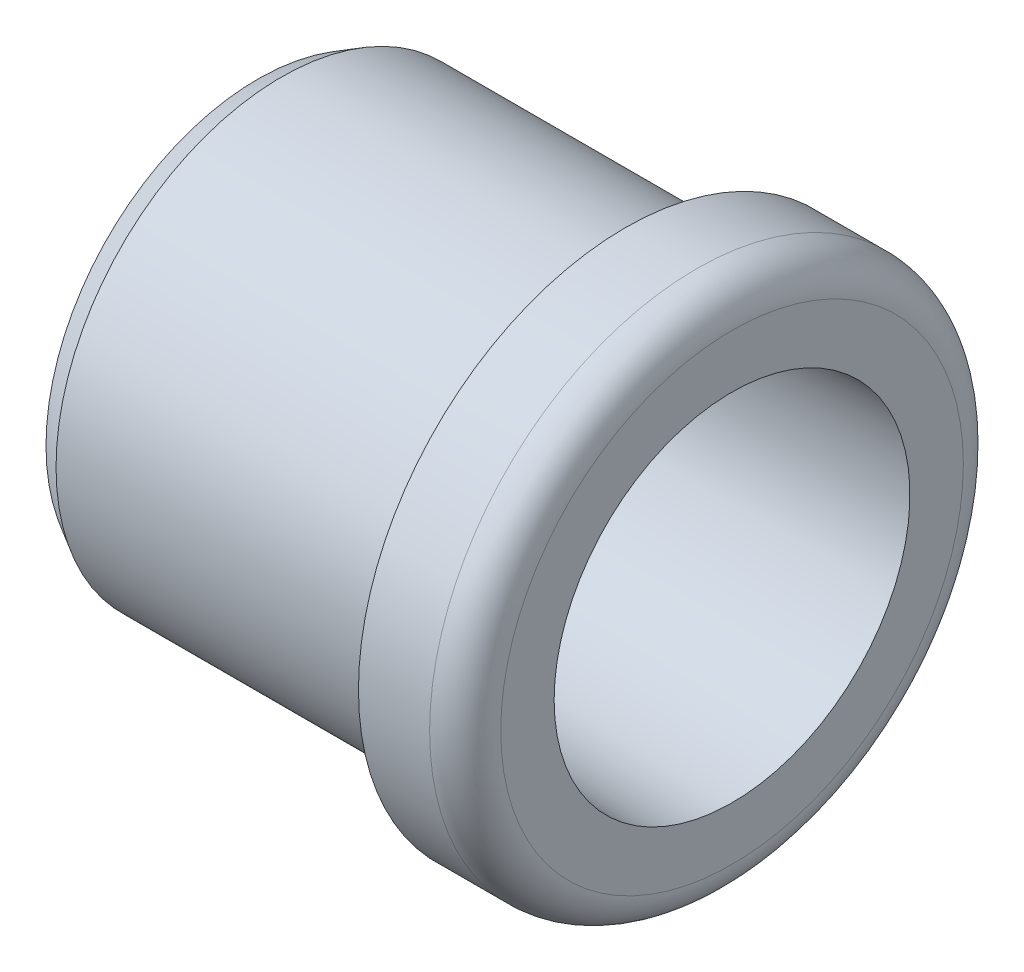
from build123d import *


with BuildPart() as part:
    # Sketch1 → Revolve1 (revolve)
    with BuildSketch(Plane.XY, mode=Mode.PRIVATE) as revolve1_sk:
        with BuildLine():
            Line((0, 17.845299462), (2, 19))
            Line((2, 19), (31, 19))
            Line((31, 19), (31, 22.5))
            Line((31, 22.5), (37, 22.5))
            ThreePointArc((37, 22.5), (39.121320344, 21.621320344), (40, 19.5))
            Line((40, 19.5), (40, 15))
            Line((40, 15), (12.772080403, 14.049180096))
            ThreePointArc((12.772080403, 14.049180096), (12.22452816, 13.805394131), (12, 13.249667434))
            Line((12, 13.249667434), (12, 5.1))
            Line((12, 5.1), (0, 5.1))
            Line((0, 5.1), (0, 17.845299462))
        make_face()
    revolve(revolve1_sk.sketch.rotate(Axis((0, 0, 0), (1, 0, 0)), 90), axis=Axis((0, 0, 0), (1, 0, 0)))


solid = part.part
